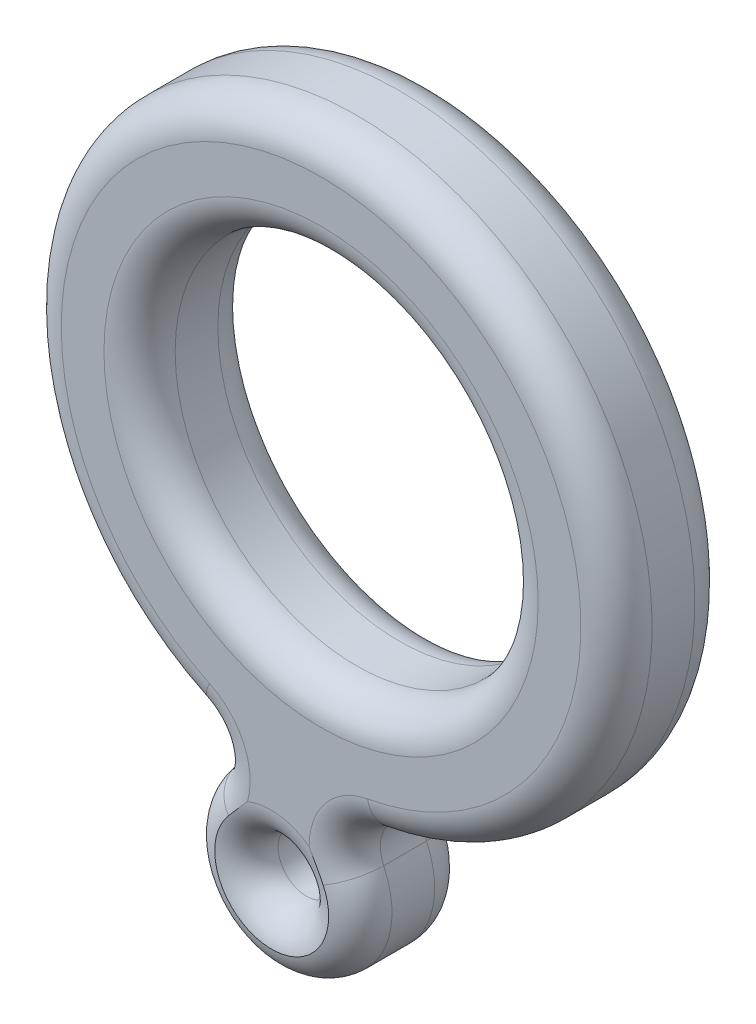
ISO-10303-21;
HEADER;
FILE_DESCRIPTION(('STEP AP214'),'2;1');
FILE_NAME('part.step','',(''),(''),'','','');
FILE_SCHEMA(('AUTOMOTIVE_DESIGN { 1 0 10303 214 1 1 1 1 }'));
ENDSEC;
DATA;
#1=APPLICATION_CONTEXT('core data for automotive mechanical design processes');
#2=APPLICATION_PROTOCOL_DEFINITION('international standard','automotive_design',2000,#1);
#3=PRODUCT_CONTEXT('',#1,'mechanical');
#4=PRODUCT('Part','Part','',(#3));
#5=PRODUCT_RELATED_PRODUCT_CATEGORY('part','',(#4));
#6=PRODUCT_DEFINITION_FORMATION('','',#4);
#7=PRODUCT_DEFINITION_CONTEXT('part definition',#1,'design');
#8=PRODUCT_DEFINITION('design','',#6,#7);
#9=PRODUCT_DEFINITION_SHAPE('','',#8);
#10=(LENGTH_UNIT() NAMED_UNIT(*) SI_UNIT(.MILLI.,.METRE.));
#11=(NAMED_UNIT(*) PLANE_ANGLE_UNIT() SI_UNIT($,.RADIAN.));
#12=(NAMED_UNIT(*) SI_UNIT($,.STERADIAN.) SOLID_ANGLE_UNIT());
#13=UNCERTAINTY_MEASURE_WITH_UNIT(LENGTH_MEASURE(1.E-05),#10,'distance_accuracy_value','');
#14=(GEOMETRIC_REPRESENTATION_CONTEXT(3) GLOBAL_UNCERTAINTY_ASSIGNED_CONTEXT((#13)) GLOBAL_UNIT_ASSIGNED_CONTEXT((#10,
#11,#12)) REPRESENTATION_CONTEXT('',''));
#15=CARTESIAN_POINT('',(0.,0.,0.));
#16=DIRECTION('',(0.,0.,1.));
#17=DIRECTION('',(1.,0.,0.));
#18=AXIS2_PLACEMENT_3D('',#15,#16,#17);
#19=CARTESIAN_POINT('',(0.320584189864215,-24.6960973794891,8.));
#20=DIRECTION('',(0.,0.,1.));
#21=DIRECTION('',(1.,0.,0.));
#22=AXIS2_PLACEMENT_3D('',#19,#20,#21);
#23=PLANE('',#22);
#24=CARTESIAN_POINT('',(-9.9831600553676,-20.9975954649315,8.));
#25=DIRECTION('',(0.,0.,1.));
#26=DIRECTION('',(1.,0.,0.));
#27=AXIS2_PLACEMENT_3D('',#24,#25,#26);
#28=CIRCLE('',#27,5.);
#29=CARTESIAN_POINT('',(-7.83624391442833,-16.4819835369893,8.));
#30=VERTEX_POINT('',#29);
#31=CARTESIAN_POINT('',(-5.16357910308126,-22.3286249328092,8.));
#32=VERTEX_POINT('',#31);
#33=EDGE_CURVE('E41',#30,#32,#28,.F.);
#34=ORIENTED_EDGE('',*,*,#33,.T.);
#35=CARTESIAN_POINT('',(-3.51934660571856,-26.5174791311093,8.));
#36=DIRECTION('',(0.,0.,1.));
#37=DIRECTION('',(1.,0.,0.));
#38=AXIS2_PLACEMENT_3D('',#35,#36,#37);
#39=CIRCLE('',#38,4.5);
#40=CARTESIAN_POINT('',(-0.839407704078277,-22.9025202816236,8.));
#41=VERTEX_POINT('',#40);
#42=EDGE_CURVE('E11',#32,#41,#39,.F.);
#43=ORIENTED_EDGE('',*,*,#42,.T.);
#44=CARTESIAN_POINT('',(4.16051498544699,-22.8747156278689,8.));
#45=DIRECTION('',(0.,0.,1.));
#46=DIRECTION('',(1.,0.,0.));
#47=AXIS2_PLACEMENT_3D('',#44,#45,#46);
#48=CIRCLE('',#47,5.);
#49=CARTESIAN_POINT('',(3.26578057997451,-17.9554219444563,8.));
#50=VERTEX_POINT('',#49);
#51=EDGE_CURVE('E89',#41,#50,#48,.F.);
#52=ORIENTED_EDGE('',*,*,#51,.T.);
#53=CARTESIAN_POINT('',(0.,0.,8.));
#54=DIRECTION('',(0.,0.,1.));
#55=DIRECTION('',(1.,0.,0.));
#56=AXIS2_PLACEMENT_3D('',#53,#54,#55);
#57=CIRCLE('',#56,18.25);
#58=EDGE_CURVE('E285',#50,#30,#57,.T.);
#59=ORIENTED_EDGE('',*,*,#58,.T.);
#60=EDGE_LOOP('',(#34,#43,#52,#59));
#61=FACE_BOUND('',#60,.T.);
#62=CARTESIAN_POINT('',(0.,0.,8.));
#63=DIRECTION('',(0.,0.,1.));
#64=DIRECTION('',(1.,0.,0.));
#65=AXIS2_PLACEMENT_3D('',#62,#63,#64);
#66=CIRCLE('',#65,15.25);
#67=CARTESIAN_POINT('',(15.25,0.,8.));
#68=VERTEX_POINT('',#67);
#69=EDGE_CURVE('E281',#68,#68,#66,.F.);
#70=ORIENTED_EDGE('',*,*,#69,.T.);
#71=EDGE_LOOP('',(#70));
#72=FACE_BOUND('',#71,.T.);
#73=ADVANCED_FACE('F31',(#61,#72),#23,.T.);
#74=CARTESIAN_POINT('',(0.320584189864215,-24.6960973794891,0.));
#75=DIRECTION('',(0.,0.,1.));
#76=DIRECTION('',(1.,0.,0.));
#77=AXIS2_PLACEMENT_3D('',#74,#75,#76);
#78=PLANE('',#77);
#79=CARTESIAN_POINT('',(-3.51934660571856,-26.5174791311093,0.));
#80=DIRECTION('',(0.,0.,1.));
#81=DIRECTION('',(1.,0.,0.));
#82=AXIS2_PLACEMENT_3D('',#79,#80,#81);
#83=CIRCLE('',#82,4.5);
#84=CARTESIAN_POINT('',(-0.839407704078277,-22.9025202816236,0.));
#85=VERTEX_POINT('',#84);
#86=CARTESIAN_POINT('',(-5.16357910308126,-22.3286249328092,0.));
#87=VERTEX_POINT('',#86);
#88=EDGE_CURVE('E250',#85,#87,#83,.T.);
#89=ORIENTED_EDGE('',*,*,#88,.T.);
#90=CARTESIAN_POINT('',(-9.9831600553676,-20.9975954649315,0.));
#91=DIRECTION('',(0.,0.,1.));
#92=DIRECTION('',(1.,0.,0.));
#93=AXIS2_PLACEMENT_3D('',#90,#91,#92);
#94=CIRCLE('',#93,5.);
#95=CARTESIAN_POINT('',(-7.83624391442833,-16.4819835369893,0.));
#96=VERTEX_POINT('',#95);
#97=EDGE_CURVE('E253',#87,#96,#94,.T.);
#98=ORIENTED_EDGE('',*,*,#97,.T.);
#99=CARTESIAN_POINT('',(0.,0.,0.));
#100=DIRECTION('',(0.,0.,1.));
#101=DIRECTION('',(1.,0.,0.));
#102=AXIS2_PLACEMENT_3D('',#99,#100,#101);
#103=CIRCLE('',#102,18.25);
#104=CARTESIAN_POINT('',(3.26578057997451,-17.9554219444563,0.));
#105=VERTEX_POINT('',#104);
#106=EDGE_CURVE('E247',#96,#105,#103,.F.);
#107=ORIENTED_EDGE('',*,*,#106,.T.);
#108=CARTESIAN_POINT('',(4.16051498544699,-22.8747156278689,0.));
#109=DIRECTION('',(0.,0.,1.));
#110=DIRECTION('',(1.,0.,0.));
#111=AXIS2_PLACEMENT_3D('',#108,#109,#110);
#112=CIRCLE('',#111,5.);
#113=EDGE_CURVE('E244',#105,#85,#112,.T.);
#114=ORIENTED_EDGE('',*,*,#113,.T.);
#115=EDGE_LOOP('',(#89,#98,#107,#114));
#116=FACE_BOUND('',#115,.T.);
#117=CARTESIAN_POINT('',(0.,0.,0.));
#118=DIRECTION('',(0.,0.,1.));
#119=DIRECTION('',(1.,0.,0.));
#120=AXIS2_PLACEMENT_3D('',#117,#118,#119);
#121=CIRCLE('',#120,15.25);
#122=CARTESIAN_POINT('',(15.25,0.,0.));
#123=VERTEX_POINT('',#122);
#124=EDGE_CURVE('E241',#123,#123,#121,.T.);
#125=ORIENTED_EDGE('',*,*,#124,.T.);
#126=EDGE_LOOP('',(#125));
#127=FACE_BOUND('',#126,.T.);
#128=ADVANCED_FACE('F132',(#116,#127),#78,.F.);
#129=CARTESIAN_POINT('',(4.16051498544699,-22.8747156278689,8.));
#130=DIRECTION('',(0.,0.,-1.));
#131=DIRECTION('',(-1.,0.,0.));
#132=AXIS2_PLACEMENT_3D('',#129,#130,#131);
#133=CYLINDRICAL_SURFACE('',#132,2.5);
#134=DIRECTION('',(0.,0.,-1.));
#135=VECTOR('',#134,1.);
#136=CARTESIAN_POINT('',(1.90173216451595,-23.9461166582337,8.));
#137=LINE('',#136,#135);
#138=CARTESIAN_POINT('',(1.90173216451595,-23.9461166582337,5.5));
#139=VERTEX_POINT('',#138);
#140=CARTESIAN_POINT('',(1.90173216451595,-23.9461166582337,2.5));
#141=VERTEX_POINT('',#140);
#142=EDGE_CURVE('E227',#139,#141,#137,.T.);
#143=ORIENTED_EDGE('',*,*,#142,.T.);
#144=CARTESIAN_POINT('',(4.16051498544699,-22.8747156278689,2.5));
#145=DIRECTION('',(0.,0.,1.));
#146=DIRECTION('',(1.,0.,0.));
#147=AXIS2_PLACEMENT_3D('',#144,#145,#146);
#148=CIRCLE('',#147,2.5);
#149=CARTESIAN_POINT('',(3.71314778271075,-20.4150687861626,2.5));
#150=VERTEX_POINT('',#149);
#151=EDGE_CURVE('E272',#141,#150,#148,.F.);
#152=ORIENTED_EDGE('',*,*,#151,.T.);
#153=DIRECTION('',(0.,0.,-1.));
#154=VECTOR('',#153,1.);
#155=CARTESIAN_POINT('',(3.71314778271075,-20.4150687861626,8.));
#156=LINE('',#155,#154);
#157=CARTESIAN_POINT('',(3.71314778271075,-20.4150687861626,5.5));
#158=VERTEX_POINT('',#157);
#159=EDGE_CURVE('E234',#158,#150,#156,.T.);
#160=ORIENTED_EDGE('',*,*,#159,.F.);
#161=CARTESIAN_POINT('',(4.16051498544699,-22.8747156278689,5.5));
#162=DIRECTION('',(0.,0.,1.));
#163=DIRECTION('',(1.,0.,0.));
#164=AXIS2_PLACEMENT_3D('',#161,#162,#163);
#165=CIRCLE('',#164,2.5);
#166=EDGE_CURVE('E269',#158,#139,#165,.T.);
#167=ORIENTED_EDGE('',*,*,#166,.T.);
#168=EDGE_LOOP('',(#143,#152,#160,#167));
#169=FACE_BOUND('',#168,.T.);
#170=ADVANCED_FACE('F137',(#169),#133,.F.);
#171=CARTESIAN_POINT('',(0.,0.,8.));
#172=DIRECTION('',(0.,0.,-1.));
#173=DIRECTION('',(-1.,0.,0.));
#174=AXIS2_PLACEMENT_3D('',#171,#172,#173);
#175=CYLINDRICAL_SURFACE('',#174,20.75);
#176=ORIENTED_EDGE('',*,*,#159,.T.);
#177=CARTESIAN_POINT('',(0.,0.,2.5));
#178=DIRECTION('',(0.,0.,1.));
#179=DIRECTION('',(1.,0.,0.));
#180=AXIS2_PLACEMENT_3D('',#177,#178,#179);
#181=CIRCLE('',#180,20.75);
#182=CARTESIAN_POINT('',(-8.90970198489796,-18.7397895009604,2.5));
#183=VERTEX_POINT('',#182);
#184=EDGE_CURVE('E219',#150,#183,#181,.T.);
#185=ORIENTED_EDGE('',*,*,#184,.T.);
#186=DIRECTION('',(0.,0.,-1.));
#187=VECTOR('',#186,1.);
#188=CARTESIAN_POINT('',(-8.90970198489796,-18.7397895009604,8.));
#189=LINE('',#188,#187);
#190=CARTESIAN_POINT('',(-8.90970198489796,-18.7397895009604,5.5));
#191=VERTEX_POINT('',#190);
#192=EDGE_CURVE('E232',#191,#183,#189,.T.);
#193=ORIENTED_EDGE('',*,*,#192,.F.);
#194=CARTESIAN_POINT('',(0.,0.,5.5));
#195=DIRECTION('',(0.,0.,1.));
#196=DIRECTION('',(1.,0.,0.));
#197=AXIS2_PLACEMENT_3D('',#194,#195,#196);
#198=CIRCLE('',#197,20.75);
#199=EDGE_CURVE('E262',#191,#158,#198,.F.);
#200=ORIENTED_EDGE('',*,*,#199,.T.);
#201=EDGE_LOOP('',(#176,#185,#193,#200));
#202=FACE_BOUND('',#201,.T.);
#203=ADVANCED_FACE('F152',(#202),#175,.T.);
#204=CARTESIAN_POINT('',(-9.9831600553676,-20.9975954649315,8.));
#205=DIRECTION('',(0.,0.,-1.));
#206=DIRECTION('',(-1.,0.,0.));
#207=AXIS2_PLACEMENT_3D('',#204,#205,#206);
#208=CYLINDRICAL_SURFACE('',#207,2.5);
#209=ORIENTED_EDGE('',*,*,#192,.T.);
#210=CARTESIAN_POINT('',(-9.9831600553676,-20.9975954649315,2.5));
#211=DIRECTION('',(0.,0.,1.));
#212=DIRECTION('',(1.,0.,0.));
#213=AXIS2_PLACEMENT_3D('',#210,#211,#212);
#214=CIRCLE('',#213,2.5);
#215=CARTESIAN_POINT('',(-8.08203845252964,-22.6210906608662,2.5));
#216=VERTEX_POINT('',#215);
#217=EDGE_CURVE('E218',#183,#216,#214,.F.);
#218=ORIENTED_EDGE('',*,*,#217,.T.);
#219=DIRECTION('',(0.,0.,-1.));
#220=VECTOR('',#219,1.);
#221=CARTESIAN_POINT('',(-8.08203845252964,-22.6210906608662,8.));
#222=LINE('',#221,#220);
#223=CARTESIAN_POINT('',(-8.08203845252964,-22.6210906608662,5.5));
#224=VERTEX_POINT('',#223);
#225=EDGE_CURVE('E224',#224,#216,#222,.T.);
#226=ORIENTED_EDGE('',*,*,#225,.F.);
#227=CARTESIAN_POINT('',(-9.9831600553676,-20.9975954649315,5.5));
#228=DIRECTION('',(0.,0.,1.));
#229=DIRECTION('',(1.,0.,0.));
#230=AXIS2_PLACEMENT_3D('',#227,#228,#229);
#231=CIRCLE('',#230,2.5);
#232=EDGE_CURVE('E210',#224,#191,#231,.T.);
#233=ORIENTED_EDGE('',*,*,#232,.T.);
#234=EDGE_LOOP('',(#209,#218,#226,#233));
#235=FACE_BOUND('',#234,.T.);
#236=ADVANCED_FACE('F148',(#235),#208,.F.);
#237=CARTESIAN_POINT('',(-3.51934660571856,-26.5174791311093,8.));
#238=DIRECTION('',(0.,0.,-1.));
#239=DIRECTION('',(-1.,0.,0.));
#240=AXIS2_PLACEMENT_3D('',#237,#238,#239);
#241=CYLINDRICAL_SURFACE('',#240,6.);
#242=ORIENTED_EDGE('',*,*,#225,.T.);
#243=CARTESIAN_POINT('',(-3.51934660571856,-26.5174791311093,2.5));
#244=DIRECTION('',(0.,0.,1.));
#245=DIRECTION('',(1.,0.,0.));
#246=AXIS2_PLACEMENT_3D('',#243,#244,#245);
#247=CIRCLE('',#246,6.);
#248=EDGE_CURVE('E228',#216,#141,#247,.T.);
#249=ORIENTED_EDGE('',*,*,#248,.T.);
#250=ORIENTED_EDGE('',*,*,#142,.F.);
#251=CARTESIAN_POINT('',(-3.51934660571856,-26.5174791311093,5.5));
#252=DIRECTION('',(0.,0.,1.));
#253=DIRECTION('',(1.,0.,0.));
#254=AXIS2_PLACEMENT_3D('',#251,#252,#253);
#255=CIRCLE('',#254,6.);
#256=EDGE_CURVE('E79',#139,#224,#255,.F.);
#257=ORIENTED_EDGE('',*,*,#256,.T.);
#258=EDGE_LOOP('',(#242,#249,#250,#257));
#259=FACE_BOUND('',#258,.T.);
#260=ADVANCED_FACE('F145',(#259),#241,.T.);
#261=CARTESIAN_POINT('',(0.,0.,8.));
#262=DIRECTION('',(0.,0.,-1.));
#263=DIRECTION('',(-1.,0.,0.));
#264=AXIS2_PLACEMENT_3D('',#261,#262,#263);
#265=CYLINDRICAL_SURFACE('',#264,12.75);
#266=CARTESIAN_POINT('',(0.,0.,2.5));
#267=DIRECTION('',(0.,0.,1.));
#268=DIRECTION('',(1.,0.,0.));
#269=AXIS2_PLACEMENT_3D('',#266,#267,#268);
#270=CIRCLE('',#269,12.75);
#271=CARTESIAN_POINT('',(12.75,0.,2.5));
#272=VERTEX_POINT('',#271);
#273=EDGE_CURVE('E278',#272,#272,#270,.F.);
#274=ORIENTED_EDGE('',*,*,#273,.T.);
#275=EDGE_LOOP('',(#274));
#276=FACE_BOUND('',#275,.T.);
#277=CARTESIAN_POINT('',(0.,0.,5.5));
#278=DIRECTION('',(0.,0.,1.));
#279=DIRECTION('',(1.,0.,0.));
#280=AXIS2_PLACEMENT_3D('',#277,#278,#279);
#281=CIRCLE('',#280,12.75);
#282=CARTESIAN_POINT('',(12.75,0.,5.5));
#283=VERTEX_POINT('',#282);
#284=EDGE_CURVE('E275',#283,#283,#281,.T.);
#285=ORIENTED_EDGE('',*,*,#284,.T.);
#286=EDGE_LOOP('',(#285));
#287=FACE_BOUND('',#286,.T.);
#288=ADVANCED_FACE('F142',(#276,#287),#265,.F.);
#289=CARTESIAN_POINT('',(-3.51934660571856,-26.5174791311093,8.));
#290=DIRECTION('',(0.,0.,-1.));
#291=DIRECTION('',(-1.,0.,0.));
#292=AXIS2_PLACEMENT_3D('',#289,#290,#291);
#293=CYLINDRICAL_SURFACE('',#292,2.);
#294=CARTESIAN_POINT('',(-3.51934660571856,-26.5174791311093,2.5));
#295=DIRECTION('',(0.,0.,1.));
#296=DIRECTION('',(1.,0.,0.));
#297=AXIS2_PLACEMENT_3D('',#294,#295,#296);
#298=CIRCLE('',#297,2.);
#299=CARTESIAN_POINT('',(-1.51934660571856,-26.5174791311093,2.5));
#300=VERTEX_POINT('',#299);
#301=EDGE_CURVE('E259',#300,#300,#298,.F.);
#302=ORIENTED_EDGE('',*,*,#301,.T.);
#303=EDGE_LOOP('',(#302));
#304=FACE_BOUND('',#303,.T.);
#305=CARTESIAN_POINT('',(-3.51934660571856,-26.5174791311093,5.5));
#306=DIRECTION('',(0.,0.,1.));
#307=DIRECTION('',(1.,0.,0.));
#308=AXIS2_PLACEMENT_3D('',#305,#306,#307);
#309=CIRCLE('',#308,2.);
#310=CARTESIAN_POINT('',(-1.51934660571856,-26.5174791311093,5.5));
#311=VERTEX_POINT('',#310);
#312=EDGE_CURVE('E256',#311,#311,#309,.T.);
#313=ORIENTED_EDGE('',*,*,#312,.T.);
#314=EDGE_LOOP('',(#313));
#315=FACE_BOUND('',#314,.T.);
#316=ADVANCED_FACE('F200',(#304,#315),#293,.F.);
#317=CARTESIAN_POINT('',(0.,0.,2.5));
#318=DIRECTION('',(0.,0.,1.));
#319=DIRECTION('',(1.,0.,0.));
#320=AXIS2_PLACEMENT_3D('',#317,#318,#319);
#321=TOROIDAL_SURFACE('',#320,18.25,2.5);
#322=CARTESIAN_POINT('',(3.26578057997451,-17.9554219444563,2.5));
#323=DIRECTION('',(-0.983858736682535,-0.178946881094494,0.));
#324=DIRECTION('',(0.178946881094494,-0.983858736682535,0.));
#325=AXIS2_PLACEMENT_3D('',#322,#323,#324);
#326=CIRCLE('',#325,2.5);
#327=EDGE_CURVE('E183',#105,#150,#326,.T.);
#328=ORIENTED_EDGE('',*,*,#327,.F.);
#329=ORIENTED_EDGE('',*,*,#106,.F.);
#330=CARTESIAN_POINT('',(-7.83624391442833,-16.4819835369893,2.5));
#331=DIRECTION('',(0.903122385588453,-0.429383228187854,0.));
#332=DIRECTION('',(0.429383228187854,0.903122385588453,0.));
#333=AXIS2_PLACEMENT_3D('',#330,#331,#332);
#334=CIRCLE('',#333,2.5);
#335=EDGE_CURVE('E236',#183,#96,#334,.T.);
#336=ORIENTED_EDGE('',*,*,#335,.F.);
#337=ORIENTED_EDGE('',*,*,#184,.F.);
#338=EDGE_LOOP('',(#328,#329,#336,#337));
#339=FACE_BOUND('',#338,.T.);
#340=ADVANCED_FACE('F191',(#339),#321,.T.);
#341=CARTESIAN_POINT('',(-9.9831600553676,-20.9975954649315,2.5));
#342=DIRECTION('',(0.,0.,1.));
#343=DIRECTION('',(1.,0.,0.));
#344=AXIS2_PLACEMENT_3D('',#341,#342,#343);
#345=TOROIDAL_SURFACE('',#344,5.,2.5);
#346=CARTESIAN_POINT('',(-6.1809168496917,-24.2445858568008,2.5));
#347=DIRECTION('',(-0.649398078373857,-0.76044864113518,0.));
#348=DIRECTION('',(0.76044864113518,-0.649398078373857,0.));
#349=AXIS2_PLACEMENT_3D('',#346,#347,#348);
#350=CIRCLE('',#349,2.5);
#351=CARTESIAN_POINT('',(-6.56114117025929,-23.9198868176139,0.0505102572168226));
#352=VERTEX_POINT('',#351);
#353=EDGE_CURVE('E325',#216,#352,#350,.T.);
#354=ORIENTED_EDGE('',*,*,#353,.F.);
#355=ORIENTED_EDGE('',*,*,#217,.F.);
#356=ORIENTED_EDGE('',*,*,#335,.T.);
#357=ORIENTED_EDGE('',*,*,#97,.F.);
#358=CARTESIAN_POINT('',(-6.83693982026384,-24.2447858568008,0.0462415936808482));
#359=CARTESIAN_POINT('',(-6.80288368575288,-24.204426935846,0.0472748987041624));
#360=CARTESIAN_POINT('',(-6.76878149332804,-24.1641023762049,0.0481318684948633));
#361=CARTESIAN_POINT('',(-6.70048583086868,-24.0835241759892,0.0494675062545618));
#362=CARTESIAN_POINT('',(-6.66629236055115,-24.0432705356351,0.0499461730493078));
#363=CARTESIAN_POINT('',(-6.56358404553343,-23.9226284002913,0.0507762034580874));
#364=CARTESIAN_POINT('',(-6.49493389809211,-23.8423499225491,0.0505218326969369));
#365=CARTESIAN_POINT('',(-6.35730869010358,-23.682126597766,0.0484344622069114));
#366=CARTESIAN_POINT('',(-6.28833370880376,-23.6021816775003,0.0466018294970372));
#367=CARTESIAN_POINT('',(-6.15006003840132,-23.4426122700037,0.0416622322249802));
#368=CARTESIAN_POINT('',(-6.08076134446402,-23.3629877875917,0.0385552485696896));
#369=CARTESIAN_POINT('',(-5.94189537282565,-23.2040978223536,0.0315976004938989));
#370=CARTESIAN_POINT('',(-5.87232829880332,-23.1248321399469,0.027747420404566));
#371=CARTESIAN_POINT('',(-5.7328830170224,-22.9665772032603,0.0200088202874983));
#372=CARTESIAN_POINT('',(-5.66300479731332,-22.8875879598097,0.0161203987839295));
#373=CARTESIAN_POINT('',(-5.45292819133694,-22.6510059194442,0.00562734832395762));
#374=CARTESIAN_POINT('',(-5.31224794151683,-22.4937531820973,0.000192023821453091));
#375=CARTESIAN_POINT('',(-5.16856671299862,-22.3341638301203,1.67542367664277E-06));
#376=CARTESIAN_POINT('',(-5.16607298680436,-22.3313943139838,9.01830661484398E-09));
#377=CARTESIAN_POINT('',(-5.16357910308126,-22.3286249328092,0.));
#378=B_SPLINE_CURVE_WITH_KNOTS('',3,(#358,#359,#360,#361,#362,#363,#364,#365,#366,#367,#368,
#369,#370,#371,#372,#373,#374,#375,#376,#377),.UNSPECIFIED.,.F.,.F.,(4,2,2,2,2,2,2,2,2,4),(0.,
0.15845325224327,0.316906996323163,0.633780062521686,0.950579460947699,1.26738360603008,
1.58398198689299,1.90059263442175,2.53363181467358,2.54481215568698),.UNSPECIFIED.);
#379=EDGE_CURVE('E176',#352,#87,#378,.T.);
#380=ORIENTED_EDGE('',*,*,#379,.F.);
#381=EDGE_LOOP('',(#354,#355,#356,#357,#380));
#382=FACE_BOUND('',#381,.T.);
#383=ADVANCED_FACE('F186',(#382),#345,.T.);
#384=CARTESIAN_POINT('',(-3.51934660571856,-26.5174791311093,2.5));
#385=DIRECTION('',(0.,0.,1.));
#386=DIRECTION('',(1.,0.,0.));
#387=AXIS2_PLACEMENT_3D('',#384,#385,#386);
#388=TOROIDAL_SURFACE('',#387,3.5,2.5);
#389=CARTESIAN_POINT('',(-0.357050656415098,-25.0175176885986,2.5));
#390=DIRECTION('',(-0.428560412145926,0.903513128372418,0.));
#391=DIRECTION('',(-0.903513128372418,-0.428560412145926,0.));
#392=AXIS2_PLACEMENT_3D('',#389,#390,#391);
#393=CIRCLE('',#392,2.5);
#394=CARTESIAN_POINT('',(0.0947059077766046,-24.8032374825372,0.0505102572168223));
#395=VERTEX_POINT('',#394);
#396=EDGE_CURVE('E319',#141,#395,#393,.T.);
#397=ORIENTED_EDGE('',*,*,#396,.F.);
#398=ORIENTED_EDGE('',*,*,#248,.F.);
#399=ORIENTED_EDGE('',*,*,#353,.T.);
#400=CARTESIAN_POINT('',(-3.51934660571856,-26.5174791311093,0.0505102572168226));
#401=DIRECTION('',(0.,0.,-1.));
#402=DIRECTION('',(-1.,0.,0.));
#403=AXIS2_PLACEMENT_3D('',#400,#401,#402);
#404=CIRCLE('',#403,4.);
#405=EDGE_CURVE('E172',#395,#352,#404,.T.);
#406=ORIENTED_EDGE('',*,*,#405,.F.);
#407=EDGE_LOOP('',(#397,#398,#399,#406));
#408=FACE_BOUND('',#407,.T.);
#409=ADVANCED_FACE('F190',(#408),#388,.T.);
#410=CARTESIAN_POINT('',(4.16051498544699,-22.8747156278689,2.5));
#411=DIRECTION('',(0.,0.,1.));
#412=DIRECTION('',(1.,0.,0.));
#413=AXIS2_PLACEMENT_3D('',#410,#411,#412);
#414=TOROIDAL_SURFACE('',#413,5.,2.5);
#415=ORIENTED_EDGE('',*,*,#151,.F.);
#416=ORIENTED_EDGE('',*,*,#396,.T.);
#417=CARTESIAN_POINT('',(-0.839407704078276,-22.9025202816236,0.));
#418=CARTESIAN_POINT('',(-0.837722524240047,-22.9058442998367,3.24109753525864E-09));
#419=CARTESIAN_POINT('',(-0.836037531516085,-22.9091684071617,1.66975235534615E-06));
#420=CARTESIAN_POINT('',(-0.746069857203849,-23.0866787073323,0.000178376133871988));
#421=CARTESIAN_POINT('',(-0.658302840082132,-23.2611092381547,0.004861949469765));
#422=CARTESIAN_POINT('',(-0.483996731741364,-23.6104793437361,0.0173120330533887));
#423=CARTESIAN_POINT('',(-0.397457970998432,-23.7854190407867,0.0250793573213));
#424=CARTESIAN_POINT('',(-0.268592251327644,-24.0484303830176,0.0352751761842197));
#425=CARTESIAN_POINT('',(-0.225780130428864,-24.1362301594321,0.0384320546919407));
#426=CARTESIAN_POINT('',(-0.140491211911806,-24.3120195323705,0.0438108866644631));
#427=CARTESIAN_POINT('',(-0.0980144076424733,-24.4000091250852,0.0460328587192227));
#428=CARTESIAN_POINT('',(-0.0134061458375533,-24.57618071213,0.0492083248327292));
#429=CARTESIAN_POINT('',(0.0287253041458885,-24.6643627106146,0.0501617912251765));
#430=CARTESIAN_POINT('',(0.112635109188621,-24.8409094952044,0.0507075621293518));
#431=CARTESIAN_POINT('',(0.154413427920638,-24.9292742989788,0.0502997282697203));
#432=CARTESIAN_POINT('',(0.196007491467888,-25.0177176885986,0.0491648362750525));
#433=B_SPLINE_CURVE_WITH_KNOTS('',3,(#417,#418,#419,#420,#421,#422,#423,#424,#425,#426,#427,
#428,#429,#430,#431,#432),.UNSPECIFIED.,.F.,.F.,(4,2,2,2,2,2,2,4),(0.,0.0111803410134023,
0.597024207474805,1.18302282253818,1.47621540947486,1.76940216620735,2.06259531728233,
2.35581827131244),.UNSPECIFIED.);
#434=EDGE_CURVE('E166',#85,#395,#433,.T.);
#435=ORIENTED_EDGE('',*,*,#434,.F.);
#436=ORIENTED_EDGE('',*,*,#113,.F.);
#437=ORIENTED_EDGE('',*,*,#327,.T.);
#438=EDGE_LOOP('',(#415,#416,#435,#436,#437));
#439=FACE_BOUND('',#438,.T.);
#440=ADVANCED_FACE('F162',(#439),#414,.T.);
#441=CARTESIAN_POINT('',(-3.51934660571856,-26.5174791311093,2.5));
#442=DIRECTION('',(0.,0.,1.));
#443=DIRECTION('',(1.,0.,0.));
#444=AXIS2_PLACEMENT_3D('',#441,#442,#443);
#445=TOROIDAL_SURFACE('',#444,4.5,2.5);
#446=ORIENTED_EDGE('',*,*,#301,.F.);
#447=EDGE_LOOP('',(#446));
#448=FACE_BOUND('',#447,.T.);
#449=ORIENTED_EDGE('',*,*,#405,.T.);
#450=ORIENTED_EDGE('',*,*,#379,.T.);
#451=ORIENTED_EDGE('',*,*,#88,.F.);
#452=ORIENTED_EDGE('',*,*,#434,.T.);
#453=EDGE_LOOP('',(#449,#450,#451,#452));
#454=FACE_BOUND('',#453,.T.);
#455=ADVANCED_FACE('F127',(#448,#454),#445,.T.);
#456=CARTESIAN_POINT('',(0.,0.,2.5));
#457=DIRECTION('',(0.,0.,1.));
#458=DIRECTION('',(1.,0.,0.));
#459=AXIS2_PLACEMENT_3D('',#456,#457,#458);
#460=TOROIDAL_SURFACE('',#459,15.25,2.5);
#461=ORIENTED_EDGE('',*,*,#273,.F.);
#462=EDGE_LOOP('',(#461));
#463=FACE_BOUND('',#462,.T.);
#464=ORIENTED_EDGE('',*,*,#124,.F.);
#465=EDGE_LOOP('',(#464));
#466=FACE_BOUND('',#465,.T.);
#467=ADVANCED_FACE('F122',(#463,#466),#460,.T.);
#468=CARTESIAN_POINT('',(0.,0.,5.5));
#469=DIRECTION('',(0.,0.,1.));
#470=DIRECTION('',(1.,0.,0.));
#471=AXIS2_PLACEMENT_3D('',#468,#469,#470);
#472=TOROIDAL_SURFACE('',#471,18.25,2.5);
#473=CARTESIAN_POINT('',(-7.83624391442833,-16.4819835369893,5.5));
#474=DIRECTION('',(0.903122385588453,-0.429383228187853,0.));
#475=DIRECTION('',(0.429383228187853,0.903122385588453,0.));
#476=AXIS2_PLACEMENT_3D('',#473,#474,#475);
#477=CIRCLE('',#476,2.5);
#478=EDGE_CURVE('E92',#30,#191,#477,.T.);
#479=ORIENTED_EDGE('',*,*,#478,.F.);
#480=ORIENTED_EDGE('',*,*,#58,.F.);
#481=CARTESIAN_POINT('',(3.26578057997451,-17.9554219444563,5.5));
#482=DIRECTION('',(-0.983858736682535,-0.178946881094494,0.));
#483=DIRECTION('',(0.178946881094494,-0.983858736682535,0.));
#484=AXIS2_PLACEMENT_3D('',#481,#482,#483);
#485=CIRCLE('',#484,2.5);
#486=EDGE_CURVE('E35',#158,#50,#485,.T.);
#487=ORIENTED_EDGE('',*,*,#486,.F.);
#488=ORIENTED_EDGE('',*,*,#199,.F.);
#489=EDGE_LOOP('',(#479,#480,#487,#488));
#490=FACE_BOUND('',#489,.T.);
#491=ADVANCED_FACE('F116',(#490),#472,.T.);
#492=CARTESIAN_POINT('',(4.16051498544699,-22.8747156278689,5.5));
#493=DIRECTION('',(0.,0.,1.));
#494=DIRECTION('',(1.,0.,0.));
#495=AXIS2_PLACEMENT_3D('',#492,#493,#494);
#496=TOROIDAL_SURFACE('',#495,5.,2.5);
#497=CARTESIAN_POINT('',(-0.3570506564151,-25.0175176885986,5.5));
#498=DIRECTION('',(0.428560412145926,-0.903513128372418,0.));
#499=DIRECTION('',(0.903513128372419,0.428560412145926,0.));
#500=AXIS2_PLACEMENT_3D('',#497,#498,#499);
#501=CIRCLE('',#500,2.5);
#502=CARTESIAN_POINT('',(0.0947059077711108,-24.8032374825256,7.94948974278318));
#503=VERTEX_POINT('',#502);
#504=EDGE_CURVE('E71',#139,#503,#501,.T.);
#505=ORIENTED_EDGE('',*,*,#504,.F.);
#506=ORIENTED_EDGE('',*,*,#166,.F.);
#507=ORIENTED_EDGE('',*,*,#486,.T.);
#508=ORIENTED_EDGE('',*,*,#51,.F.);
#509=CARTESIAN_POINT('',(0.196007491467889,-25.0177176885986,7.95083516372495));
#510=CARTESIAN_POINT('',(0.154413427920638,-24.9292742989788,7.94970027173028));
#511=CARTESIAN_POINT('',(0.112635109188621,-24.8409094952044,7.94929243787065));
#512=CARTESIAN_POINT('',(0.0287253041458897,-24.6643627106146,7.94983820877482));
#513=CARTESIAN_POINT('',(-0.0134061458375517,-24.57618071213,7.95079167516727));
#514=CARTESIAN_POINT('',(-0.0980144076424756,-24.4000091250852,7.95396714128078));
#515=CARTESIAN_POINT('',(-0.140491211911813,-24.3120195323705,7.95618911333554));
#516=CARTESIAN_POINT('',(-0.225780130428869,-24.1362301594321,7.96156794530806));
#517=CARTESIAN_POINT('',(-0.268592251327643,-24.0484303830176,7.96472482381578));
#518=CARTESIAN_POINT('',(-0.397457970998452,-23.7854190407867,7.9749206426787));
#519=CARTESIAN_POINT('',(-0.483996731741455,-23.6104793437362,7.98268796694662));
#520=CARTESIAN_POINT('',(-0.658302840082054,-23.2611092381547,7.99513805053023));
#521=CARTESIAN_POINT('',(-0.746069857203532,-23.0866787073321,7.99982162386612));
#522=CARTESIAN_POINT('',(-0.836037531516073,-22.9091684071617,7.99999833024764));
#523=CARTESIAN_POINT('',(-0.83772252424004,-22.9058442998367,7.9999999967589));
#524=CARTESIAN_POINT('',(-0.839407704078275,-22.9025202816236,8.));
#525=B_SPLINE_CURVE_WITH_KNOTS('',3,(#509,#510,#511,#512,#513,#514,#515,#516,#517,#518,#519,
#520,#521,#522,#523,#524),.UNSPECIFIED.,.F.,.F.,(4,2,2,2,2,2,2,4),(0.,0.293222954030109,
0.58641610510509,0.879602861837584,1.17279544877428,1.75879406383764,2.34463793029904,
2.35581827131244),.UNSPECIFIED.);
#526=EDGE_CURVE('E84',#503,#41,#525,.T.);
#527=ORIENTED_EDGE('',*,*,#526,.F.);
#528=EDGE_LOOP('',(#505,#506,#507,#508,#527));
#529=FACE_BOUND('',#528,.T.);
#530=ADVANCED_FACE('F85',(#529),#496,.T.);
#531=CARTESIAN_POINT('',(-3.51934660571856,-26.5174791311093,5.5));
#532=DIRECTION('',(0.,0.,1.));
#533=DIRECTION('',(1.,0.,0.));
#534=AXIS2_PLACEMENT_3D('',#531,#532,#533);
#535=TOROIDAL_SURFACE('',#534,3.5,2.5);
#536=CARTESIAN_POINT('',(-6.18091684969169,-24.2445858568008,5.5));
#537=DIRECTION('',(0.649398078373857,0.76044864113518,0.));
#538=DIRECTION('',(-0.76044864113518,0.649398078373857,0.));
#539=AXIS2_PLACEMENT_3D('',#536,#537,#538);
#540=CIRCLE('',#539,2.5);
#541=CARTESIAN_POINT('',(-6.56114117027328,-23.9198868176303,7.94948974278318));
#542=VERTEX_POINT('',#541);
#543=EDGE_CURVE('E65',#224,#542,#540,.T.);
#544=ORIENTED_EDGE('',*,*,#543,.F.);
#545=ORIENTED_EDGE('',*,*,#256,.F.);
#546=ORIENTED_EDGE('',*,*,#504,.T.);
#547=CARTESIAN_POINT('',(-3.51934660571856,-26.5174791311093,7.94948974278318));
#548=DIRECTION('',(0.,0.,1.));
#549=DIRECTION('',(1.,0.,0.));
#550=AXIS2_PLACEMENT_3D('',#547,#548,#549);
#551=CIRCLE('',#550,4.);
#552=EDGE_CURVE('E75',#542,#503,#551,.T.);
#553=ORIENTED_EDGE('',*,*,#552,.F.);
#554=EDGE_LOOP('',(#544,#545,#546,#553));
#555=FACE_BOUND('',#554,.T.);
#556=ADVANCED_FACE('F73',(#555),#535,.T.);
#557=CARTESIAN_POINT('',(-9.9831600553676,-20.9975954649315,5.5));
#558=DIRECTION('',(0.,0.,1.));
#559=DIRECTION('',(1.,0.,0.));
#560=AXIS2_PLACEMENT_3D('',#557,#558,#559);
#561=TOROIDAL_SURFACE('',#560,5.,2.5);
#562=ORIENTED_EDGE('',*,*,#232,.F.);
#563=ORIENTED_EDGE('',*,*,#543,.T.);
#564=CARTESIAN_POINT('',(-5.16357910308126,-22.3286249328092,8.));
#565=CARTESIAN_POINT('',(-5.16607298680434,-22.3313943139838,7.99999999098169));
#566=CARTESIAN_POINT('',(-5.16856671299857,-22.3341638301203,7.99999832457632));
#567=CARTESIAN_POINT('',(-5.3122479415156,-22.4937531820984,7.99980797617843));
#568=CARTESIAN_POINT('',(-5.45292819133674,-22.6510059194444,7.99437265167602));
#569=CARTESIAN_POINT('',(-5.66300479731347,-22.8875879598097,7.98387960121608));
#570=CARTESIAN_POINT('',(-5.73288301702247,-22.9665772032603,7.9799911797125));
#571=CARTESIAN_POINT('',(-5.87232829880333,-23.1248321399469,7.97225257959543));
#572=CARTESIAN_POINT('',(-5.94189537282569,-23.2040978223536,7.9684023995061));
#573=CARTESIAN_POINT('',(-6.08076134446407,-23.3629877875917,7.96144475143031));
#574=CARTESIAN_POINT('',(-6.15006003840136,-23.4426122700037,7.95833776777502));
#575=CARTESIAN_POINT('',(-6.28833370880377,-23.6021816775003,7.95339817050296));
#576=CARTESIAN_POINT('',(-6.35730869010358,-23.682126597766,7.95156553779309));
#577=CARTESIAN_POINT('',(-6.49493389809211,-23.8423499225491,7.94947816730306));
#578=CARTESIAN_POINT('',(-6.56358404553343,-23.9226284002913,7.94922379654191));
#579=CARTESIAN_POINT('',(-6.66629236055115,-24.0432705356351,7.95005382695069));
#580=CARTESIAN_POINT('',(-6.70048583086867,-24.0835241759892,7.95053249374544));
#581=CARTESIAN_POINT('',(-6.76878149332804,-24.1641023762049,7.95186813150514));
#582=CARTESIAN_POINT('',(-6.80288368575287,-24.204426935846,7.95272510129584));
#583=CARTESIAN_POINT('',(-6.83693982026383,-24.2447858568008,7.95375840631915));
#584=B_SPLINE_CURVE_WITH_KNOTS('',3,(#564,#565,#566,#567,#568,#569,#570,#571,#572,#573,#574,
#575,#576,#577,#578,#579,#580,#581,#582,#583),.UNSPECIFIED.,.F.,.F.,(4,2,2,2,2,2,2,2,2,4),(0.,
0.0111803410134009,0.644219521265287,0.960830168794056,1.27742854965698,1.59423269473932,
1.91103209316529,2.22790515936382,2.3863589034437,2.54481215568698),.UNSPECIFIED.);
#585=EDGE_CURVE('E96',#32,#542,#584,.T.);
#586=ORIENTED_EDGE('',*,*,#585,.F.);
#587=ORIENTED_EDGE('',*,*,#33,.F.);
#588=ORIENTED_EDGE('',*,*,#478,.T.);
#589=EDGE_LOOP('',(#562,#563,#586,#587,#588));
#590=FACE_BOUND('',#589,.T.);
#591=ADVANCED_FACE('F119',(#590),#561,.T.);
#592=CARTESIAN_POINT('',(-3.51934660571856,-26.5174791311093,5.5));
#593=DIRECTION('',(0.,0.,1.));
#594=DIRECTION('',(1.,0.,0.));
#595=AXIS2_PLACEMENT_3D('',#592,#593,#594);
#596=TOROIDAL_SURFACE('',#595,4.5,2.5);
#597=ORIENTED_EDGE('',*,*,#552,.T.);
#598=ORIENTED_EDGE('',*,*,#526,.T.);
#599=ORIENTED_EDGE('',*,*,#42,.F.);
#600=ORIENTED_EDGE('',*,*,#585,.T.);
#601=EDGE_LOOP('',(#597,#598,#599,#600));
#602=FACE_BOUND('',#601,.T.);
#603=ORIENTED_EDGE('',*,*,#312,.F.);
#604=EDGE_LOOP('',(#603));
#605=FACE_BOUND('',#604,.T.);
#606=ADVANCED_FACE('F94',(#602,#605),#596,.T.);
#607=CARTESIAN_POINT('',(0.,0.,5.5));
#608=DIRECTION('',(0.,0.,1.));
#609=DIRECTION('',(1.,0.,0.));
#610=AXIS2_PLACEMENT_3D('',#607,#608,#609);
#611=TOROIDAL_SURFACE('',#610,15.25,2.5);
#612=ORIENTED_EDGE('',*,*,#69,.F.);
#613=EDGE_LOOP('',(#612));
#614=FACE_BOUND('',#613,.T.);
#615=ORIENTED_EDGE('',*,*,#284,.F.);
#616=EDGE_LOOP('',(#615));
#617=FACE_BOUND('',#616,.T.);
#618=ADVANCED_FACE('F33',(#614,#617),#611,.T.);
#619=CLOSED_SHELL('',(#73,#128,#170,#203,#236,#260,#288,#316,#340,#383,#409,#440,#455,#467,#491,
#530,#556,#591,#606,#618));
#620=MANIFOLD_SOLID_BREP('B2',#619);
#621=ADVANCED_BREP_SHAPE_REPRESENTATION('',(#18,#620),#14);
#622=SHAPE_DEFINITION_REPRESENTATION(#9,#621);
ENDSEC;
END-ISO-10303-21;
